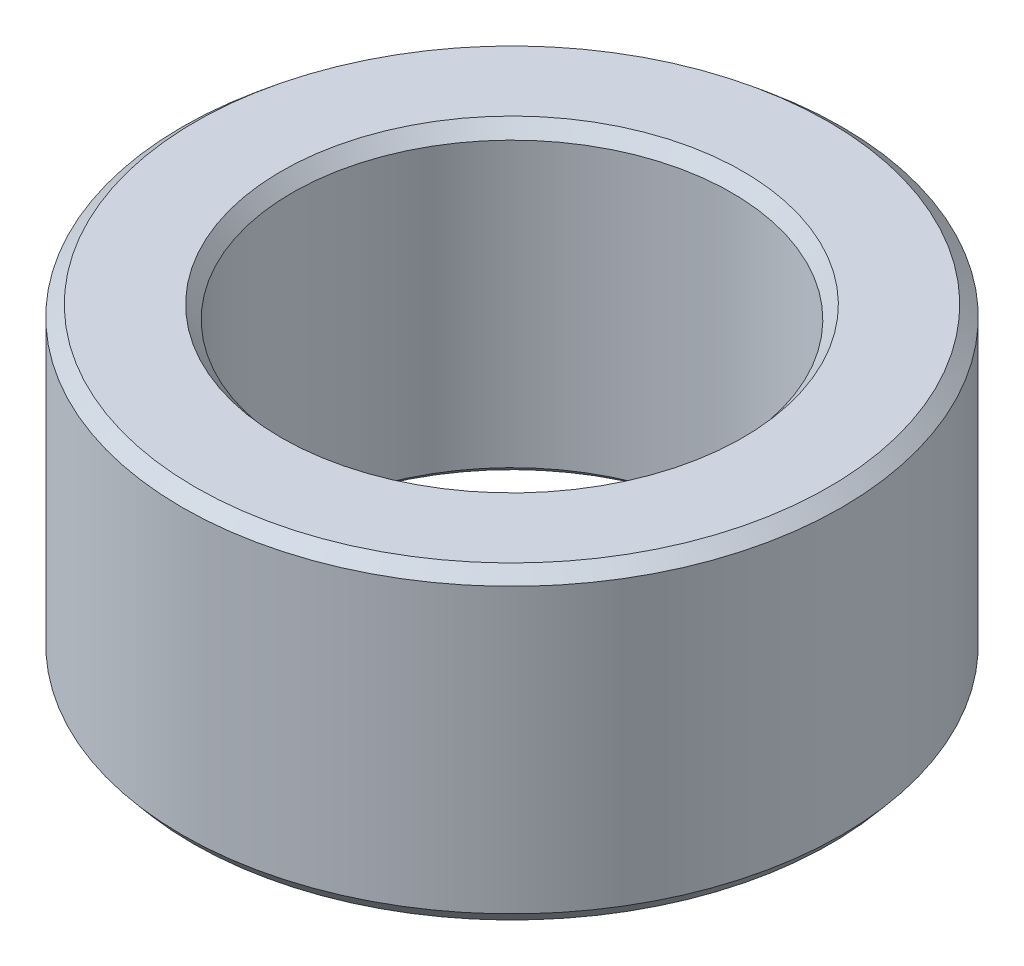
ISO-10303-21;
HEADER;
FILE_DESCRIPTION(('STEP AP214'),'2;1');
FILE_NAME('part.step','',(''),(''),'','','');
FILE_SCHEMA(('AUTOMOTIVE_DESIGN { 1 0 10303 214 1 1 1 1 }'));
ENDSEC;
DATA;
#1=APPLICATION_CONTEXT('core data for automotive mechanical design processes');
#2=APPLICATION_PROTOCOL_DEFINITION('international standard','automotive_design',2000,#1);
#3=PRODUCT_CONTEXT('',#1,'mechanical');
#4=PRODUCT('Part','Part','',(#3));
#5=PRODUCT_RELATED_PRODUCT_CATEGORY('part','',(#4));
#6=PRODUCT_DEFINITION_FORMATION('','',#4);
#7=PRODUCT_DEFINITION_CONTEXT('part definition',#1,'design');
#8=PRODUCT_DEFINITION('design','',#6,#7);
#9=PRODUCT_DEFINITION_SHAPE('','',#8);
#10=(LENGTH_UNIT() NAMED_UNIT(*) SI_UNIT(.MILLI.,.METRE.));
#11=(NAMED_UNIT(*) PLANE_ANGLE_UNIT() SI_UNIT($,.RADIAN.));
#12=(NAMED_UNIT(*) SI_UNIT($,.STERADIAN.) SOLID_ANGLE_UNIT());
#13=UNCERTAINTY_MEASURE_WITH_UNIT(LENGTH_MEASURE(1.E-05),#10,'distance_accuracy_value','');
#14=(GEOMETRIC_REPRESENTATION_CONTEXT(3) GLOBAL_UNCERTAINTY_ASSIGNED_CONTEXT((#13)) GLOBAL_UNIT_ASSIGNED_CONTEXT((#10,
#11,#12)) REPRESENTATION_CONTEXT('',''));
#15=CARTESIAN_POINT('',(0.,0.,0.));
#16=DIRECTION('',(0.,0.,1.));
#17=DIRECTION('',(1.,0.,0.));
#18=AXIS2_PLACEMENT_3D('',#15,#16,#17);
#19=CARTESIAN_POINT('',(0.,7.,0.));
#20=DIRECTION('',(0.,1.,0.));
#21=DIRECTION('',(0.,0.,1.));
#22=AXIS2_PLACEMENT_3D('',#19,#20,#21);
#23=PLANE('',#22);
#24=CARTESIAN_POINT('',(0.,7.,0.));
#25=DIRECTION('',(0.,1.,0.));
#26=DIRECTION('',(0.,0.,1.));
#27=AXIS2_PLACEMENT_3D('',#24,#25,#26);
#28=CIRCLE('',#27,10.5);
#29=CARTESIAN_POINT('',(0.,7.,10.5));
#30=VERTEX_POINT('',#29);
#31=EDGE_CURVE('E10',#30,#30,#28,.F.);
#32=ORIENTED_EDGE('',*,*,#31,.T.);
#33=EDGE_LOOP('',(#32));
#34=FACE_BOUND('',#33,.T.);
#35=CARTESIAN_POINT('',(0.,7.,0.));
#36=DIRECTION('',(0.,1.,0.));
#37=DIRECTION('',(0.,0.,1.));
#38=AXIS2_PLACEMENT_3D('',#35,#36,#37);
#39=CIRCLE('',#38,14.4041232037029);
#40=CARTESIAN_POINT('',(0.,7.,14.4041232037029));
#41=VERTEX_POINT('',#40);
#42=EDGE_CURVE('E38',#41,#41,#39,.T.);
#43=ORIENTED_EDGE('',*,*,#42,.T.);
#44=EDGE_LOOP('',(#43));
#45=FACE_BOUND('',#44,.T.);
#46=ADVANCED_FACE('F31',(#34,#45),#23,.T.);
#47=CARTESIAN_POINT('',(0.,-7.,0.));
#48=DIRECTION('',(0.,1.,0.));
#49=DIRECTION('',(0.,0.,1.));
#50=AXIS2_PLACEMENT_3D('',#47,#48,#49);
#51=PLANE('',#50);
#52=CARTESIAN_POINT('',(0.,-7.,0.));
#53=DIRECTION('',(0.,1.,0.));
#54=DIRECTION('',(0.,0.,1.));
#55=AXIS2_PLACEMENT_3D('',#52,#53,#54);
#56=CIRCLE('',#55,10.5958767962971);
#57=CARTESIAN_POINT('',(0.,-7.,10.5958767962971));
#58=VERTEX_POINT('',#57);
#59=EDGE_CURVE('E57',#58,#58,#56,.T.);
#60=ORIENTED_EDGE('',*,*,#59,.T.);
#61=EDGE_LOOP('',(#60));
#62=FACE_BOUND('',#61,.T.);
#63=CARTESIAN_POINT('',(0.,-7.,0.));
#64=DIRECTION('',(0.,1.,0.));
#65=DIRECTION('',(0.,0.,1.));
#66=AXIS2_PLACEMENT_3D('',#63,#64,#65);
#67=CIRCLE('',#66,14.5);
#68=CARTESIAN_POINT('',(0.,-7.,14.5));
#69=VERTEX_POINT('',#68);
#70=EDGE_CURVE('E60',#69,#69,#67,.F.);
#71=ORIENTED_EDGE('',*,*,#70,.T.);
#72=EDGE_LOOP('',(#71));
#73=FACE_BOUND('',#72,.T.);
#74=ADVANCED_FACE('F64',(#62,#73),#51,.F.);
#75=CARTESIAN_POINT('',(0.,7.,0.));
#76=DIRECTION('',(0.,-1.,0.));
#77=DIRECTION('',(0.,0.,-1.));
#78=AXIS2_PLACEMENT_3D('',#75,#76,#77);
#79=CYLINDRICAL_SURFACE('',#78,15.);
#80=CARTESIAN_POINT('',(0.,-6.4041232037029,0.));
#81=DIRECTION('',(0.,1.,0.));
#82=DIRECTION('',(0.,0.,1.));
#83=AXIS2_PLACEMENT_3D('',#80,#81,#82);
#84=CIRCLE('',#83,15.);
#85=CARTESIAN_POINT('',(0.,-6.4041232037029,15.));
#86=VERTEX_POINT('',#85);
#87=EDGE_CURVE('E42',#86,#86,#84,.T.);
#88=ORIENTED_EDGE('',*,*,#87,.T.);
#89=EDGE_LOOP('',(#88));
#90=FACE_BOUND('',#89,.T.);
#91=CARTESIAN_POINT('',(0.,6.49999999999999,0.));
#92=DIRECTION('',(0.,1.,0.));
#93=DIRECTION('',(0.,0.,1.));
#94=AXIS2_PLACEMENT_3D('',#91,#92,#93);
#95=CIRCLE('',#94,15.);
#96=CARTESIAN_POINT('',(0.,6.49999999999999,15.));
#97=VERTEX_POINT('',#96);
#98=EDGE_CURVE('E46',#97,#97,#95,.F.);
#99=ORIENTED_EDGE('',*,*,#98,.T.);
#100=EDGE_LOOP('',(#99));
#101=FACE_BOUND('',#100,.T.);
#102=ADVANCED_FACE('F74',(#90,#101),#79,.T.);
#103=CARTESIAN_POINT('',(0.,7.,0.));
#104=DIRECTION('',(0.,-1.,0.));
#105=DIRECTION('',(0.,0.,-1.));
#106=AXIS2_PLACEMENT_3D('',#103,#104,#105);
#107=CYLINDRICAL_SURFACE('',#106,10.);
#108=CARTESIAN_POINT('',(0.,-6.5,0.));
#109=DIRECTION('',(0.,1.,0.));
#110=DIRECTION('',(0.,0.,1.));
#111=AXIS2_PLACEMENT_3D('',#108,#109,#110);
#112=CIRCLE('',#111,10.);
#113=CARTESIAN_POINT('',(0.,-6.5,10.));
#114=VERTEX_POINT('',#113);
#115=EDGE_CURVE('E51',#114,#114,#112,.F.);
#116=ORIENTED_EDGE('',*,*,#115,.T.);
#117=EDGE_LOOP('',(#116));
#118=FACE_BOUND('',#117,.T.);
#119=CARTESIAN_POINT('',(0.,6.4041232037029,0.));
#120=DIRECTION('',(0.,1.,0.));
#121=DIRECTION('',(0.,0.,1.));
#122=AXIS2_PLACEMENT_3D('',#119,#120,#121);
#123=CIRCLE('',#122,10.);
#124=CARTESIAN_POINT('',(0.,6.4041232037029,10.));
#125=VERTEX_POINT('',#124);
#126=EDGE_CURVE('E54',#125,#125,#123,.T.);
#127=ORIENTED_EDGE('',*,*,#126,.T.);
#128=EDGE_LOOP('',(#127));
#129=FACE_BOUND('',#128,.T.);
#130=ADVANCED_FACE('F77',(#118,#129),#107,.F.);
#131=CARTESIAN_POINT('',(0.,-7.,0.));
#132=DIRECTION('',(0.,-1.,0.));
#133=DIRECTION('',(0.,0.,-1.));
#134=AXIS2_PLACEMENT_3D('',#131,#132,#133);
#135=CONICAL_SURFACE('',#134,10.5958767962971,0.872664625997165);
#136=ORIENTED_EDGE('',*,*,#115,.F.);
#137=EDGE_LOOP('',(#136));
#138=FACE_BOUND('',#137,.T.);
#139=ORIENTED_EDGE('',*,*,#59,.F.);
#140=EDGE_LOOP('',(#139));
#141=FACE_BOUND('',#140,.T.);
#142=ADVANCED_FACE('F70',(#138,#141),#135,.F.);
#143=CARTESIAN_POINT('',(0.,-6.4041232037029,0.));
#144=DIRECTION('',(0.,1.,0.));
#145=DIRECTION('',(0.,0.,1.));
#146=AXIS2_PLACEMENT_3D('',#143,#144,#145);
#147=CONICAL_SURFACE('',#146,15.,0.698131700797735);
#148=ORIENTED_EDGE('',*,*,#70,.F.);
#149=EDGE_LOOP('',(#148));
#150=FACE_BOUND('',#149,.T.);
#151=ORIENTED_EDGE('',*,*,#87,.F.);
#152=EDGE_LOOP('',(#151));
#153=FACE_BOUND('',#152,.T.);
#154=ADVANCED_FACE('F66',(#150,#153),#147,.T.);
#155=CARTESIAN_POINT('',(0.,6.4041232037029,0.));
#156=DIRECTION('',(0.,1.,0.));
#157=DIRECTION('',(0.,0.,1.));
#158=AXIS2_PLACEMENT_3D('',#155,#156,#157);
#159=CONICAL_SURFACE('',#158,10.,0.698131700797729);
#160=ORIENTED_EDGE('',*,*,#31,.F.);
#161=EDGE_LOOP('',(#160));
#162=FACE_BOUND('',#161,.T.);
#163=ORIENTED_EDGE('',*,*,#126,.F.);
#164=EDGE_LOOP('',(#163));
#165=FACE_BOUND('',#164,.T.);
#166=ADVANCED_FACE('F69',(#162,#165),#159,.F.);
#167=CARTESIAN_POINT('',(0.,7.,0.));
#168=DIRECTION('',(0.,-1.,0.));
#169=DIRECTION('',(0.,0.,-1.));
#170=AXIS2_PLACEMENT_3D('',#167,#168,#169);
#171=CONICAL_SURFACE('',#170,14.4041232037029,0.872664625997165);
#172=ORIENTED_EDGE('',*,*,#98,.F.);
#173=EDGE_LOOP('',(#172));
#174=FACE_BOUND('',#173,.T.);
#175=ORIENTED_EDGE('',*,*,#42,.F.);
#176=EDGE_LOOP('',(#175));
#177=FACE_BOUND('',#176,.T.);
#178=ADVANCED_FACE('F33',(#174,#177),#171,.T.);
#179=CLOSED_SHELL('',(#46,#74,#102,#130,#142,#154,#166,#178));
#180=MANIFOLD_SOLID_BREP('B2',#179);
#181=ADVANCED_BREP_SHAPE_REPRESENTATION('',(#18,#180),#14);
#182=SHAPE_DEFINITION_REPRESENTATION(#9,#181);
ENDSEC;
END-ISO-10303-21;
